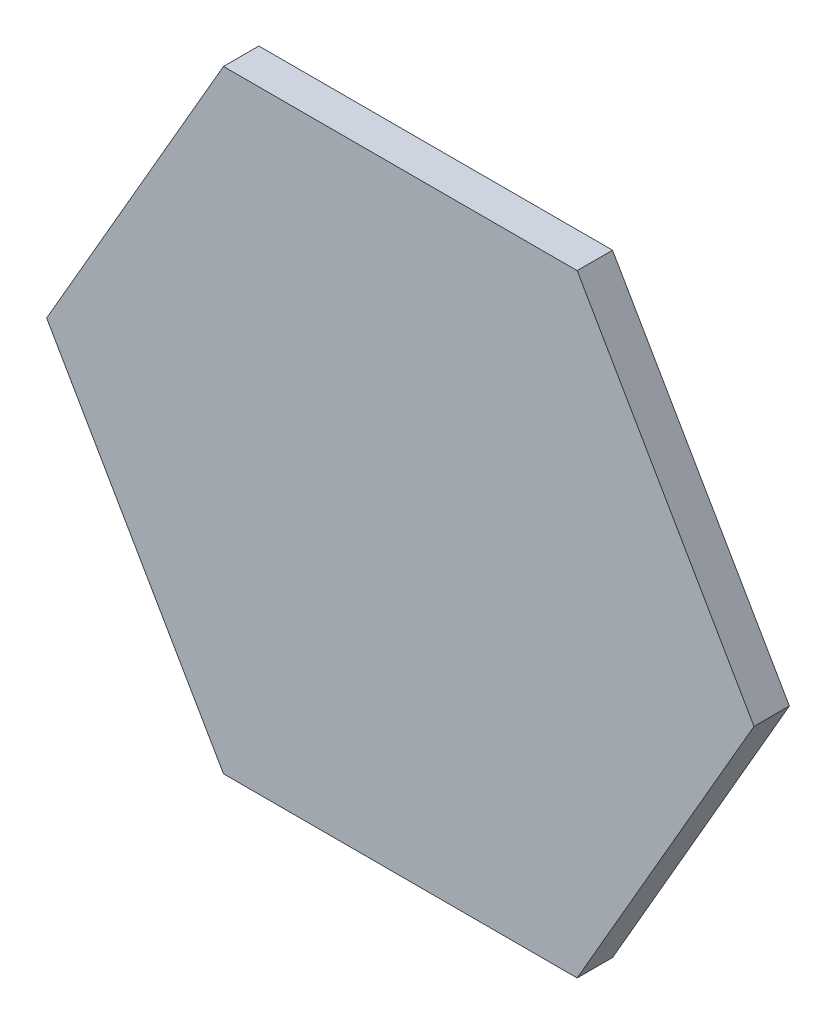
from build123d import *

# Parameters (mm, degrees)
BOSS_EXTRUDE1_DEPTH = 1.27


with BuildPart() as part:
    # Sketch1 → Boss-Extrude1 (new, symmetric)
    with BuildSketch(Plane.XY):
        Polygon((25.4, 0), (12.7, 21.997045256), (-12.7, 21.997045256), (-25.4, 0), (-12.7, -21.997045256), (12.7, -21.997045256), align=None)
    extrude(amount=BOSS_EXTRUDE1_DEPTH, both=True)


solid = part.part
